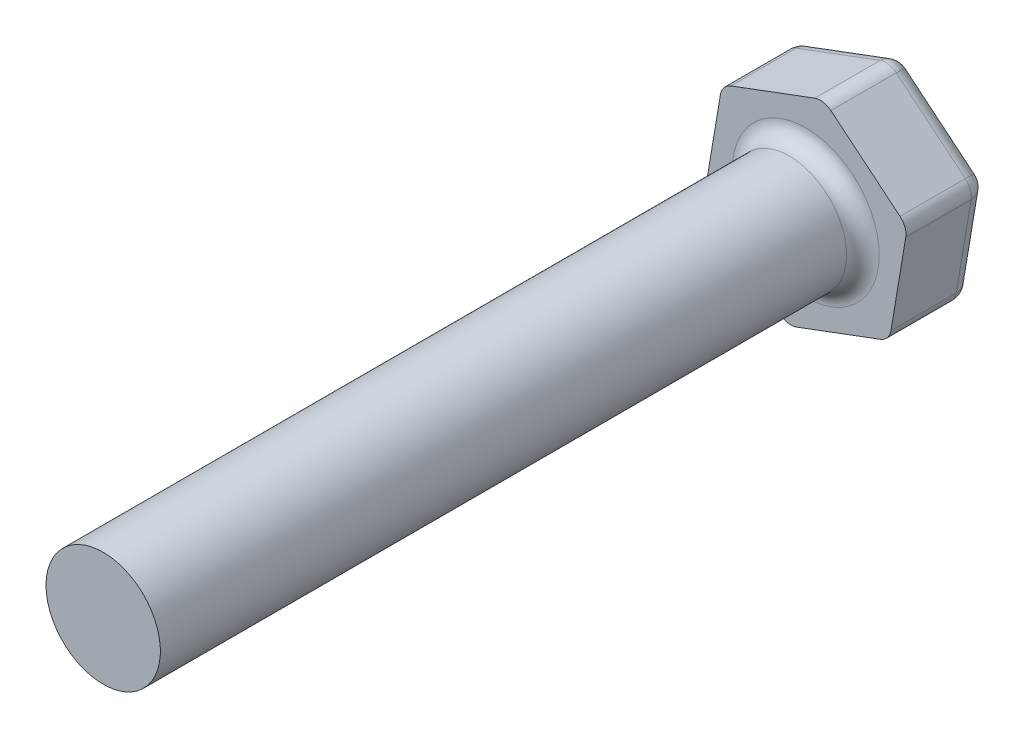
ISO-10303-21;
HEADER;
FILE_DESCRIPTION(('STEP AP214'),'2;1');
FILE_NAME('part.step','',(''),(''),'','','');
FILE_SCHEMA(('AUTOMOTIVE_DESIGN { 1 0 10303 214 1 1 1 1 }'));
ENDSEC;
DATA;
#1=APPLICATION_CONTEXT('core data for automotive mechanical design processes');
#2=APPLICATION_PROTOCOL_DEFINITION('international standard','automotive_design',2000,#1);
#3=PRODUCT_CONTEXT('',#1,'mechanical');
#4=PRODUCT('Part','Part','',(#3));
#5=PRODUCT_RELATED_PRODUCT_CATEGORY('part','',(#4));
#6=PRODUCT_DEFINITION_FORMATION('','',#4);
#7=PRODUCT_DEFINITION_CONTEXT('part definition',#1,'design');
#8=PRODUCT_DEFINITION('design','',#6,#7);
#9=PRODUCT_DEFINITION_SHAPE('','',#8);
#10=(LENGTH_UNIT() NAMED_UNIT(*) SI_UNIT(.MILLI.,.METRE.));
#11=(NAMED_UNIT(*) PLANE_ANGLE_UNIT() SI_UNIT($,.RADIAN.));
#12=(NAMED_UNIT(*) SI_UNIT($,.STERADIAN.) SOLID_ANGLE_UNIT());
#13=UNCERTAINTY_MEASURE_WITH_UNIT(LENGTH_MEASURE(1.E-05),#10,'distance_accuracy_value','');
#14=(GEOMETRIC_REPRESENTATION_CONTEXT(3) GLOBAL_UNCERTAINTY_ASSIGNED_CONTEXT((#13)) GLOBAL_UNIT_ASSIGNED_CONTEXT((#10,
#11,#12)) REPRESENTATION_CONTEXT('',''));
#15=CARTESIAN_POINT('',(0.,0.,0.));
#16=DIRECTION('',(0.,0.,1.));
#17=DIRECTION('',(1.,0.,0.));
#18=AXIS2_PLACEMENT_3D('',#15,#16,#17);
#19=CARTESIAN_POINT('',(-20.4941550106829,4.15454619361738,-4.));
#20=DIRECTION('',(0.,0.,-1.));
#21=DIRECTION('',(-1.,0.,0.));
#22=AXIS2_PLACEMENT_3D('',#19,#20,#21);
#23=PLANE('',#22);
#24=CARTESIAN_POINT('',(-20.4941550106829,4.15454619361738,-4.));
#25=DIRECTION('',(0.,0.,-1.));
#26=DIRECTION('',(-1.,0.,0.));
#27=AXIS2_PLACEMENT_3D('',#24,#25,#26);
#28=CIRCLE('',#27,4.5);
#29=CARTESIAN_POINT('',(-24.9941550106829,4.15454619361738,-4.));
#30=VERTEX_POINT('',#29);
#31=EDGE_CURVE('E163',#30,#30,#28,.T.);
#32=ORIENTED_EDGE('',*,*,#31,.T.);
#33=EDGE_LOOP('',(#32));
#34=FACE_BOUND('',#33,.T.);
#35=ADVANCED_FACE('F16',(#34),#23,.T.);
#36=CARTESIAN_POINT('',(-20.4941550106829,4.15454619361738,-4.));
#37=DIRECTION('',(0.,0.,-1.));
#38=DIRECTION('',(-1.,0.,0.));
#39=AXIS2_PLACEMENT_3D('',#36,#37,#38);
#40=CYLINDRICAL_SURFACE('',#39,4.5);
#41=CARTESIAN_POINT('',(-20.4941550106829,4.15454619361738,-5.));
#42=DIRECTION('',(0.,0.,-1.));
#43=DIRECTION('',(-1.,0.,0.));
#44=AXIS2_PLACEMENT_3D('',#41,#42,#43);
#45=CIRCLE('',#44,4.5);
#46=CARTESIAN_POINT('',(-24.9941550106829,4.15454619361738,-5.));
#47=VERTEX_POINT('',#46);
#48=EDGE_CURVE('E160',#47,#47,#45,.F.);
#49=ORIENTED_EDGE('',*,*,#48,.F.);
#50=EDGE_LOOP('',(#49));
#51=FACE_BOUND('',#50,.T.);
#52=ORIENTED_EDGE('',*,*,#31,.F.);
#53=EDGE_LOOP('',(#52));
#54=FACE_BOUND('',#53,.T.);
#55=ADVANCED_FACE('F489',(#51,#54),#40,.F.);
#56=CARTESIAN_POINT('',(-24.6377443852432,7.51985898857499,-4.));
#57=DIRECTION('',(1.,0.,0.));
#58=DIRECTION('',(0.,0.,-1.));
#59=AXIS2_PLACEMENT_3D('',#56,#57,#58);
#60=SPHERICAL_SURFACE('',#59,1.);
#61=CARTESIAN_POINT('',(-24.6377443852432,7.51985898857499,-4.));
#62=DIRECTION('',(-0.93679219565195,-0.349886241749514,0.));
#63=DIRECTION('',(0.349886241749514,-0.93679219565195,0.));
#64=AXIS2_PLACEMENT_3D('',#61,#62,#63);
#65=CIRCLE('',#64,1.);
#66=CARTESIAN_POINT('',(-24.6377443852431,7.519858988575,-5.));
#67=VERTEX_POINT('',#66);
#68=CARTESIAN_POINT('',(-24.9876306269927,8.45665118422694,-4.));
#69=VERTEX_POINT('',#68);
#70=EDGE_CURVE('E212',#67,#69,#65,.F.);
#71=ORIENTED_EDGE('',*,*,#70,.F.);
#72=CARTESIAN_POINT('',(-24.6377443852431,7.519858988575,-4.));
#73=DIRECTION('',(-0.165385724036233,-0.986228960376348,0.));
#74=DIRECTION('',(0.986228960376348,-0.165385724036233,0.));
#75=AXIS2_PLACEMENT_3D('',#72,#73,#74);
#76=CIRCLE('',#75,0.999999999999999);
#77=CARTESIAN_POINT('',(-25.6239733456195,7.68524471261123,-4.));
#78=VERTEX_POINT('',#77);
#79=EDGE_CURVE('E134',#78,#67,#76,.T.);
#80=ORIENTED_EDGE('',*,*,#79,.F.);
#81=CARTESIAN_POINT('',(-24.6377443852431,7.51985898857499,-4.));
#82=DIRECTION('',(0.,0.,1.));
#83=DIRECTION('',(1.,0.,0.));
#84=AXIS2_PLACEMENT_3D('',#81,#82,#83);
#85=CIRCLE('',#84,1.);
#86=EDGE_CURVE('E218',#69,#78,#85,.T.);
#87=ORIENTED_EDGE('',*,*,#86,.F.);
#88=EDGE_LOOP('',(#71,#80,#87));
#89=FACE_BOUND('',#88,.T.);
#90=ADVANCED_FACE('F484',(#89),#60,.T.);
#91=CARTESIAN_POINT('',(-19.4996007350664,9.43892468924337,-4.));
#92=DIRECTION('',(1.,0.,0.));
#93=DIRECTION('',(0.,0.,-1.));
#94=AXIS2_PLACEMENT_3D('',#91,#92,#93);
#95=SPHERICAL_SURFACE('',#94,1.);
#96=CARTESIAN_POINT('',(-19.4996007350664,9.43892468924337,-4.));
#97=DIRECTION('',(-0.93679219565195,-0.349886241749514,0.));
#98=DIRECTION('',(0.349886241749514,-0.93679219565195,0.));
#99=AXIS2_PLACEMENT_3D('',#96,#97,#98);
#100=CIRCLE('',#99,1.);
#101=CARTESIAN_POINT('',(-19.8494869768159,10.3757168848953,-4.));
#102=VERTEX_POINT('',#101);
#103=CARTESIAN_POINT('',(-19.4996007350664,9.43892468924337,-5.));
#104=VERTEX_POINT('',#103);
#105=EDGE_CURVE('E209',#102,#104,#100,.T.);
#106=ORIENTED_EDGE('',*,*,#105,.F.);
#107=CARTESIAN_POINT('',(-19.4996007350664,9.43892468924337,-4.));
#108=DIRECTION('',(0.,0.,1.));
#109=DIRECTION('',(1.,0.,0.));
#110=AXIS2_PLACEMENT_3D('',#107,#108,#109);
#111=CIRCLE('',#110,1.);
#112=CARTESIAN_POINT('',(-18.8632580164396,10.2103311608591,-4.));
#113=VERTEX_POINT('',#112);
#114=EDGE_CURVE('E207',#113,#102,#111,.T.);
#115=ORIENTED_EDGE('',*,*,#114,.F.);
#116=CARTESIAN_POINT('',(-19.4996007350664,9.43892468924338,-4.));
#117=DIRECTION('',(-0.771406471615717,0.636342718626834,0.));
#118=DIRECTION('',(-0.636342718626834,-0.771406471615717,0.));
#119=AXIS2_PLACEMENT_3D('',#116,#117,#118);
#120=CIRCLE('',#119,1.);
#121=EDGE_CURVE('E201',#104,#113,#120,.F.);
#122=ORIENTED_EDGE('',*,*,#121,.F.);
#123=EDGE_LOOP('',(#106,#115,#122));
#124=FACE_BOUND('',#123,.T.);
#125=ADVANCED_FACE('F380',(#124),#95,.T.);
#126=CARTESIAN_POINT('',(-15.2685692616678,5.94869461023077,-4.));
#127=DIRECTION('',(1.,0.,0.));
#128=DIRECTION('',(0.,0.,-1.));
#129=AXIS2_PLACEMENT_3D('',#126,#127,#128);
#130=SPHERICAL_SURFACE('',#129,1.);
#131=CARTESIAN_POINT('',(-15.2685692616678,5.94869461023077,-4.));
#132=DIRECTION('',(0.165385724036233,0.986228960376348,0.));
#133=DIRECTION('',(-0.986228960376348,0.165385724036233,0.));
#134=AXIS2_PLACEMENT_3D('',#131,#132,#133);
#135=CIRCLE('',#134,0.999999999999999);
#136=CARTESIAN_POINT('',(-15.2685692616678,5.94869461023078,-5.));
#137=VERTEX_POINT('',#136);
#138=CARTESIAN_POINT('',(-14.2823403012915,5.78330888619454,-4.));
#139=VERTEX_POINT('',#138);
#140=EDGE_CURVE('E191',#137,#139,#135,.F.);
#141=ORIENTED_EDGE('',*,*,#140,.F.);
#142=CARTESIAN_POINT('',(-15.2685692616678,5.94869461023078,-4.));
#143=DIRECTION('',(-0.771406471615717,0.636342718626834,0.));
#144=DIRECTION('',(-0.636342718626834,-0.771406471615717,0.));
#145=AXIS2_PLACEMENT_3D('',#142,#143,#144);
#146=CIRCLE('',#145,1.);
#147=CARTESIAN_POINT('',(-14.632226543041,6.7201010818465,-4.));
#148=VERTEX_POINT('',#147);
#149=EDGE_CURVE('E198',#148,#137,#146,.T.);
#150=ORIENTED_EDGE('',*,*,#149,.F.);
#151=CARTESIAN_POINT('',(-15.2685692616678,5.94869461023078,-4.));
#152=DIRECTION('',(0.,0.,1.));
#153=DIRECTION('',(1.,0.,0.));
#154=AXIS2_PLACEMENT_3D('',#151,#152,#153);
#155=CIRCLE('',#154,0.999999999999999);
#156=CARTESIAN_POINT('',(-14.2685692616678,5.94869461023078,-4.));
#157=VERTEX_POINT('',#156);
#158=EDGE_CURVE('E208',#157,#148,#155,.T.);
#159=ORIENTED_EDGE('',*,*,#158,.F.);
#160=CARTESIAN_POINT('',(-15.2685692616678,5.94869461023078,-4.));
#161=DIRECTION('',(0.,0.,1.));
#162=DIRECTION('',(1.,0.,0.));
#163=AXIS2_PLACEMENT_3D('',#160,#161,#162);
#164=CIRCLE('',#163,0.999999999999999);
#165=EDGE_CURVE('E197',#139,#157,#164,.T.);
#166=ORIENTED_EDGE('',*,*,#165,.F.);
#167=EDGE_LOOP('',(#141,#150,#159,#166));
#168=FACE_BOUND('',#167,.T.);
#169=ADVANCED_FACE('F375',(#168),#130,.T.);
#170=CARTESIAN_POINT('',(-16.175681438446,0.539398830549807,-4.));
#171=DIRECTION('',(1.,0.,0.));
#172=DIRECTION('',(0.,0.,-1.));
#173=AXIS2_PLACEMENT_3D('',#170,#171,#172);
#174=SPHERICAL_SURFACE('',#173,1.);
#175=CARTESIAN_POINT('',(-16.175681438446,0.539398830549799,-4.));
#176=DIRECTION('',(0.165385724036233,0.986228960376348,0.));
#177=DIRECTION('',(-0.986228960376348,0.165385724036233,0.));
#178=AXIS2_PLACEMENT_3D('',#175,#176,#177);
#179=CIRCLE('',#178,0.999999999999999);
#180=CARTESIAN_POINT('',(-15.1894524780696,0.374013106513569,-4.));
#181=VERTEX_POINT('',#180);
#182=CARTESIAN_POINT('',(-16.175681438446,0.539398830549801,-5.));
#183=VERTEX_POINT('',#182);
#184=EDGE_CURVE('E188',#181,#183,#179,.T.);
#185=ORIENTED_EDGE('',*,*,#184,.F.);
#186=CARTESIAN_POINT('',(-16.175681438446,0.539398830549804,-4.));
#187=DIRECTION('',(0.,0.,1.));
#188=DIRECTION('',(1.,0.,0.));
#189=AXIS2_PLACEMENT_3D('',#186,#187,#188);
#190=CIRCLE('',#189,1.);
#191=CARTESIAN_POINT('',(-15.8257951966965,-0.397393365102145,-4.));
#192=VERTEX_POINT('',#191);
#193=EDGE_CURVE('E185',#192,#181,#190,.T.);
#194=ORIENTED_EDGE('',*,*,#193,.F.);
#195=CARTESIAN_POINT('',(-16.175681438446,0.539398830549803,-4.));
#196=DIRECTION('',(0.93679219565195,0.349886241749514,0.));
#197=DIRECTION('',(-0.349886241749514,0.93679219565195,0.));
#198=AXIS2_PLACEMENT_3D('',#195,#196,#197);
#199=CIRCLE('',#198,1.);
#200=EDGE_CURVE('E179',#183,#192,#199,.F.);
#201=ORIENTED_EDGE('',*,*,#200,.F.);
#202=EDGE_LOOP('',(#185,#194,#201));
#203=FACE_BOUND('',#202,.T.);
#204=ADVANCED_FACE('F372',(#203),#174,.T.);
#205=CARTESIAN_POINT('',(0.,0.,-5.));
#206=DIRECTION('',(0.,0.,-1.));
#207=DIRECTION('',(-1.,0.,0.));
#208=AXIS2_PLACEMENT_3D('',#205,#206,#207);
#209=PLANE('',#208);
#210=ORIENTED_EDGE('',*,*,#48,.T.);
#211=EDGE_LOOP('',(#210));
#212=FACE_BOUND('',#211,.T.);
#213=DIRECTION('',(-0.93679219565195,-0.349886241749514,0.));
#214=VECTOR('',#213,1.);
#215=CARTESIAN_POINT('',(-5.480951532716,14.6748057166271,-5.));
#216=LINE('',#215,#214);
#217=EDGE_CURVE('E215',#104,#67,#216,.T.);
#218=ORIENTED_EDGE('',*,*,#217,.F.);
#219=DIRECTION('',(-0.771406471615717,0.636342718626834,0.));
#220=VECTOR('',#219,1.);
#221=CARTESIAN_POINT('',(-3.26264452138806,-3.95514087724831,-5.));
#222=LINE('',#221,#220);
#223=EDGE_CURVE('E204',#137,#104,#222,.T.);
#224=ORIENTED_EDGE('',*,*,#223,.F.);
#225=DIRECTION('',(0.165385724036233,0.986228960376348,0.));
#226=VECTOR('',#225,1.);
#227=CARTESIAN_POINT('',(-15.8212174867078,2.65314000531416,-5.));
#228=LINE('',#227,#226);
#229=EDGE_CURVE('E194',#183,#137,#228,.T.);
#230=ORIENTED_EDGE('',*,*,#229,.F.);
#231=DIRECTION('',(0.93679219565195,0.349886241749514,0.));
#232=VECTOR('',#231,1.);
#233=CARTESIAN_POINT('',(-2.1570322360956,5.77527985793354,-5.));
#234=LINE('',#233,#232);
#235=CARTESIAN_POINT('',(-21.3138250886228,-1.37966687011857,-5.));
#236=VERTEX_POINT('',#235);
#237=EDGE_CURVE('E155',#236,#183,#234,.T.);
#238=ORIENTED_EDGE('',*,*,#237,.F.);
#239=DIRECTION('',(0.771406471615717,-0.636342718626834,0.));
#240=VECTOR('',#239,1.);
#241=CARTESIAN_POINT('',(-9.30790034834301,-11.2835023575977,-5.));
#242=LINE('',#241,#240);
#243=CARTESIAN_POINT('',(-25.5448565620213,2.11056320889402,-5.));
#244=VERTEX_POINT('',#243);
#245=EDGE_CURVE('E143',#244,#236,#242,.T.);
#246=ORIENTED_EDGE('',*,*,#245,.F.);
#247=DIRECTION('',(-0.165385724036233,-0.986228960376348,0.));
#248=VECTOR('',#247,1.);
#249=CARTESIAN_POINT('',(-25.1903926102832,4.22430438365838,-5.));
#250=LINE('',#249,#248);
#251=EDGE_CURVE('E135',#67,#244,#250,.T.);
#252=ORIENTED_EDGE('',*,*,#251,.F.);
#253=EDGE_LOOP('',(#218,#224,#230,#238,#246,#252));
#254=FACE_BOUND('',#253,.T.);
#255=ADVANCED_FACE('F152',(#212,#254),#209,.T.);
#256=CARTESIAN_POINT('',(-21.3138250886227,-1.37966687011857,-4.));
#257=DIRECTION('',(1.,0.,0.));
#258=DIRECTION('',(0.,0.,-1.));
#259=AXIS2_PLACEMENT_3D('',#256,#257,#258);
#260=SPHERICAL_SURFACE('',#259,1.);
#261=CARTESIAN_POINT('',(-21.3138250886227,-1.37966687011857,-4.));
#262=DIRECTION('',(0.771406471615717,-0.636342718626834,0.));
#263=DIRECTION('',(0.636342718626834,0.771406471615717,0.));
#264=AXIS2_PLACEMENT_3D('',#261,#262,#263);
#265=CIRCLE('',#264,1.);
#266=CARTESIAN_POINT('',(-21.9501678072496,-2.15107334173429,-4.));
#267=VERTEX_POINT('',#266);
#268=EDGE_CURVE('E149',#236,#267,#265,.F.);
#269=ORIENTED_EDGE('',*,*,#268,.F.);
#270=CARTESIAN_POINT('',(-21.3138250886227,-1.37966687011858,-4.));
#271=DIRECTION('',(0.93679219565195,0.349886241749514,0.));
#272=DIRECTION('',(-0.349886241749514,0.93679219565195,0.));
#273=AXIS2_PLACEMENT_3D('',#270,#271,#272);
#274=CIRCLE('',#273,1.);
#275=CARTESIAN_POINT('',(-20.9639388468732,-2.31645906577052,-4.));
#276=VERTEX_POINT('',#275);
#277=EDGE_CURVE('E182',#276,#236,#274,.T.);
#278=ORIENTED_EDGE('',*,*,#277,.F.);
#279=CARTESIAN_POINT('',(-21.3138250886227,-1.37966687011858,-4.));
#280=DIRECTION('',(0.,0.,1.));
#281=DIRECTION('',(1.,0.,0.));
#282=AXIS2_PLACEMENT_3D('',#279,#280,#281);
#283=CIRCLE('',#282,1.);
#284=EDGE_CURVE('E156',#267,#276,#283,.T.);
#285=ORIENTED_EDGE('',*,*,#284,.F.);
#286=EDGE_LOOP('',(#269,#278,#285));
#287=FACE_BOUND('',#286,.T.);
#288=ADVANCED_FACE('F359',(#287),#260,.T.);
#289=CARTESIAN_POINT('',(-25.5448565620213,2.11056320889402,-4.));
#290=DIRECTION('',(1.,0.,0.));
#291=DIRECTION('',(0.,0.,-1.));
#292=AXIS2_PLACEMENT_3D('',#289,#290,#291);
#293=SPHERICAL_SURFACE('',#292,1.);
#294=CARTESIAN_POINT('',(-25.5448565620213,2.11056320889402,-4.));
#295=DIRECTION('',(-0.165385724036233,-0.986228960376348,0.));
#296=DIRECTION('',(0.986228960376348,-0.165385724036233,0.));
#297=AXIS2_PLACEMENT_3D('',#294,#295,#296);
#298=CIRCLE('',#297,0.999999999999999);
#299=CARTESIAN_POINT('',(-26.5310855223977,2.27594893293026,-4.));
#300=VERTEX_POINT('',#299);
#301=EDGE_CURVE('E124',#244,#300,#298,.F.);
#302=ORIENTED_EDGE('',*,*,#301,.F.);
#303=CARTESIAN_POINT('',(-25.5448565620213,2.11056320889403,-4.));
#304=DIRECTION('',(0.771406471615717,-0.636342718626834,0.));
#305=DIRECTION('',(0.636342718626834,0.771406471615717,0.));
#306=AXIS2_PLACEMENT_3D('',#303,#304,#305);
#307=CIRCLE('',#306,1.);
#308=CARTESIAN_POINT('',(-26.1811992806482,1.33915673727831,-4.));
#309=VERTEX_POINT('',#308);
#310=EDGE_CURVE('E127',#309,#244,#307,.T.);
#311=ORIENTED_EDGE('',*,*,#310,.F.);
#312=CARTESIAN_POINT('',(-25.5448565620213,2.11056320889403,-4.));
#313=DIRECTION('',(0.,0.,1.));
#314=DIRECTION('',(1.,0.,0.));
#315=AXIS2_PLACEMENT_3D('',#312,#313,#314);
#316=CIRCLE('',#315,1.);
#317=CARTESIAN_POINT('',(-26.5448565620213,2.11056320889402,-4.));
#318=VERTEX_POINT('',#317);
#319=EDGE_CURVE('E36',#318,#309,#316,.T.);
#320=ORIENTED_EDGE('',*,*,#319,.F.);
#321=CARTESIAN_POINT('',(-25.5448565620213,2.11056320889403,-4.));
#322=DIRECTION('',(0.,0.,1.));
#323=DIRECTION('',(1.,0.,0.));
#324=AXIS2_PLACEMENT_3D('',#321,#322,#323);
#325=CIRCLE('',#324,1.);
#326=EDGE_CURVE('E128',#300,#318,#325,.T.);
#327=ORIENTED_EDGE('',*,*,#326,.F.);
#328=EDGE_LOOP('',(#302,#311,#320,#327));
#329=FACE_BOUND('',#328,.T.);
#330=ADVANCED_FACE('F126',(#329),#293,.T.);
#331=CARTESIAN_POINT('',(-25.1903926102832,4.22430438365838,-4.));
#332=DIRECTION('',(-0.165385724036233,-0.986228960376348,0.));
#333=DIRECTION('',(0.986228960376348,-0.165385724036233,0.));
#334=AXIS2_PLACEMENT_3D('',#331,#332,#333);
#335=CYLINDRICAL_SURFACE('',#334,0.999999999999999);
#336=DIRECTION('',(0.165385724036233,0.986228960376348,0.));
#337=VECTOR('',#336,1.);
#338=CARTESIAN_POINT('',(-26.6265710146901,1.70654937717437,-4.));
#339=LINE('',#338,#337);
#340=EDGE_CURVE('E364',#300,#78,#339,.T.);
#341=ORIENTED_EDGE('',*,*,#340,.T.);
#342=ORIENTED_EDGE('',*,*,#79,.T.);
#343=ORIENTED_EDGE('',*,*,#251,.T.);
#344=ORIENTED_EDGE('',*,*,#301,.T.);
#345=EDGE_LOOP('',(#341,#342,#343,#344));
#346=FACE_BOUND('',#345,.T.);
#347=ADVANCED_FACE('F159',(#346),#335,.T.);
#348=CARTESIAN_POINT('',(-24.6377443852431,7.51985898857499,-5.));
#349=DIRECTION('',(0.,0.,1.));
#350=DIRECTION('',(1.,0.,0.));
#351=AXIS2_PLACEMENT_3D('',#348,#349,#350);
#352=CYLINDRICAL_SURFACE('',#351,1.);
#353=ORIENTED_EDGE('',*,*,#86,.T.);
#354=DIRECTION('',(0.,0.,1.));
#355=VECTOR('',#354,1.);
#356=CARTESIAN_POINT('',(-25.6239733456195,7.68524471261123,-5.));
#357=LINE('',#356,#355);
#358=CARTESIAN_POINT('',(-25.6239733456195,7.68524471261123,0.));
#359=VERTEX_POINT('',#358);
#360=EDGE_CURVE('E148',#78,#359,#357,.T.);
#361=ORIENTED_EDGE('',*,*,#360,.T.);
#362=CARTESIAN_POINT('',(-24.6377443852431,7.51985898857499,0.));
#363=DIRECTION('',(0.,0.,1.));
#364=DIRECTION('',(1.,0.,0.));
#365=AXIS2_PLACEMENT_3D('',#362,#363,#364);
#366=CIRCLE('',#365,1.);
#367=CARTESIAN_POINT('',(-24.9876306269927,8.45665118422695,0.));
#368=VERTEX_POINT('',#367);
#369=EDGE_CURVE('E216',#359,#368,#366,.F.);
#370=ORIENTED_EDGE('',*,*,#369,.T.);
#371=DIRECTION('',(0.,0.,1.));
#372=VECTOR('',#371,1.);
#373=CARTESIAN_POINT('',(-24.9876306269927,8.45665118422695,-5.));
#374=LINE('',#373,#372);
#375=EDGE_CURVE('E399',#368,#69,#374,.F.);
#376=ORIENTED_EDGE('',*,*,#375,.T.);
#377=EDGE_LOOP('',(#353,#361,#370,#376));
#378=FACE_BOUND('',#377,.T.);
#379=ADVANCED_FACE('F349',(#378),#352,.T.);
#380=CARTESIAN_POINT('',(-5.480951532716,14.6748057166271,-4.));
#381=DIRECTION('',(-0.93679219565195,-0.349886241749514,0.));
#382=DIRECTION('',(0.349886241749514,-0.93679219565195,0.));
#383=AXIS2_PLACEMENT_3D('',#380,#381,#382);
#384=CYLINDRICAL_SURFACE('',#383,1.);
#385=DIRECTION('',(0.93679219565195,0.349886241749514,0.));
#386=VECTOR('',#385,1.);
#387=CARTESIAN_POINT('',(-25.5284878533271,8.25464426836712,-4.));
#388=LINE('',#387,#386);
#389=EDGE_CURVE('E396',#69,#102,#388,.T.);
#390=ORIENTED_EDGE('',*,*,#389,.T.);
#391=ORIENTED_EDGE('',*,*,#105,.T.);
#392=ORIENTED_EDGE('',*,*,#217,.T.);
#393=ORIENTED_EDGE('',*,*,#70,.T.);
#394=EDGE_LOOP('',(#390,#391,#392,#393));
#395=FACE_BOUND('',#394,.T.);
#396=ADVANCED_FACE('F345',(#395),#384,.T.);
#397=CARTESIAN_POINT('',(-19.4996007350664,9.43892468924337,-5.));
#398=DIRECTION('',(0.,0.,1.));
#399=DIRECTION('',(1.,0.,0.));
#400=AXIS2_PLACEMENT_3D('',#397,#398,#399);
#401=CYLINDRICAL_SURFACE('',#400,1.);
#402=ORIENTED_EDGE('',*,*,#114,.T.);
#403=DIRECTION('',(0.,0.,1.));
#404=VECTOR('',#403,1.);
#405=CARTESIAN_POINT('',(-19.8494869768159,10.3757168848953,-5.));
#406=LINE('',#405,#404);
#407=CARTESIAN_POINT('',(-19.8494869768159,10.3757168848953,0.));
#408=VERTEX_POINT('',#407);
#409=EDGE_CURVE('E405',#102,#408,#406,.T.);
#410=ORIENTED_EDGE('',*,*,#409,.T.);
#411=CARTESIAN_POINT('',(-19.4996007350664,9.43892468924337,0.));
#412=DIRECTION('',(0.,0.,1.));
#413=DIRECTION('',(1.,0.,0.));
#414=AXIS2_PLACEMENT_3D('',#411,#412,#413);
#415=CIRCLE('',#414,1.);
#416=CARTESIAN_POINT('',(-18.8632580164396,10.2103311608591,0.));
#417=VERTEX_POINT('',#416);
#418=EDGE_CURVE('E205',#408,#417,#415,.F.);
#419=ORIENTED_EDGE('',*,*,#418,.T.);
#420=DIRECTION('',(0.,0.,1.));
#421=VECTOR('',#420,1.);
#422=CARTESIAN_POINT('',(-18.8632580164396,10.2103311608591,-5.));
#423=LINE('',#422,#421);
#424=EDGE_CURVE('E403',#417,#113,#423,.F.);
#425=ORIENTED_EDGE('',*,*,#424,.T.);
#426=EDGE_LOOP('',(#402,#410,#419,#425));
#427=FACE_BOUND('',#426,.T.);
#428=ADVANCED_FACE('F341',(#427),#401,.T.);
#429=CARTESIAN_POINT('',(-3.26264452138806,-3.95514087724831,-4.));
#430=DIRECTION('',(-0.771406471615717,0.636342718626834,0.));
#431=DIRECTION('',(-0.636342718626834,-0.771406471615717,0.));
#432=AXIS2_PLACEMENT_3D('',#429,#430,#431);
#433=CYLINDRICAL_SURFACE('',#432,1.);
#434=DIRECTION('',(0.771406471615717,-0.636342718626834,0.));
#435=VECTOR('',#434,1.);
#436=CARTESIAN_POINT('',(-19.3086297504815,10.5777238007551,-4.));
#437=LINE('',#436,#435);
#438=EDGE_CURVE('E437',#113,#148,#437,.T.);
#439=ORIENTED_EDGE('',*,*,#438,.T.);
#440=ORIENTED_EDGE('',*,*,#149,.T.);
#441=ORIENTED_EDGE('',*,*,#223,.T.);
#442=ORIENTED_EDGE('',*,*,#121,.T.);
#443=EDGE_LOOP('',(#439,#440,#441,#442));
#444=FACE_BOUND('',#443,.T.);
#445=ADVANCED_FACE('F337',(#444),#433,.T.);
#446=CARTESIAN_POINT('',(-15.2685692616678,5.94869461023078,-5.));
#447=DIRECTION('',(0.,0.,1.));
#448=DIRECTION('',(1.,0.,0.));
#449=AXIS2_PLACEMENT_3D('',#446,#447,#448);
#450=CYLINDRICAL_SURFACE('',#449,0.999999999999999);
#451=CARTESIAN_POINT('',(-15.2685692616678,5.94869461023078,0.));
#452=DIRECTION('',(0.,0.,1.));
#453=DIRECTION('',(1.,0.,0.));
#454=AXIS2_PLACEMENT_3D('',#451,#452,#453);
#455=CIRCLE('',#454,0.999999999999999);
#456=CARTESIAN_POINT('',(-14.632226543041,6.72010108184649,0.));
#457=VERTEX_POINT('',#456);
#458=CARTESIAN_POINT('',(-14.2823403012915,5.78330888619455,0.));
#459=VERTEX_POINT('',#458);
#460=EDGE_CURVE('E195',#457,#459,#455,.F.);
#461=ORIENTED_EDGE('',*,*,#460,.T.);
#462=DIRECTION('',(0.,0.,1.));
#463=VECTOR('',#462,1.);
#464=CARTESIAN_POINT('',(-14.2823403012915,5.78330888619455,-5.));
#465=LINE('',#464,#463);
#466=EDGE_CURVE('E434',#459,#139,#465,.F.);
#467=ORIENTED_EDGE('',*,*,#466,.T.);
#468=ORIENTED_EDGE('',*,*,#165,.T.);
#469=ORIENTED_EDGE('',*,*,#158,.T.);
#470=DIRECTION('',(0.,0.,1.));
#471=VECTOR('',#470,1.);
#472=CARTESIAN_POINT('',(-14.632226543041,6.72010108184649,-5.));
#473=LINE('',#472,#471);
#474=EDGE_CURVE('E398',#148,#457,#473,.T.);
#475=ORIENTED_EDGE('',*,*,#474,.T.);
#476=EDGE_LOOP('',(#461,#467,#468,#469,#475));
#477=FACE_BOUND('',#476,.T.);
#478=ADVANCED_FACE('F333',(#477),#450,.T.);
#479=CARTESIAN_POINT('',(-15.8212174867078,2.65314000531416,-4.));
#480=DIRECTION('',(0.165385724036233,0.986228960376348,0.));
#481=DIRECTION('',(-0.986228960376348,0.165385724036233,0.));
#482=AXIS2_PLACEMENT_3D('',#479,#480,#481);
#483=CYLINDRICAL_SURFACE('',#482,0.999999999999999);
#484=DIRECTION('',(-0.165385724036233,-0.986228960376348,0.));
#485=VECTOR('',#484,1.);
#486=CARTESIAN_POINT('',(-14.186854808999,6.35270844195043,-4.));
#487=LINE('',#486,#485);
#488=EDGE_CURVE('E431',#139,#181,#487,.T.);
#489=ORIENTED_EDGE('',*,*,#488,.T.);
#490=ORIENTED_EDGE('',*,*,#184,.T.);
#491=ORIENTED_EDGE('',*,*,#229,.T.);
#492=ORIENTED_EDGE('',*,*,#140,.T.);
#493=EDGE_LOOP('',(#489,#490,#491,#492));
#494=FACE_BOUND('',#493,.T.);
#495=ADVANCED_FACE('F329',(#494),#483,.T.);
#496=CARTESIAN_POINT('',(-16.175681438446,0.539398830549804,-5.));
#497=DIRECTION('',(0.,0.,1.));
#498=DIRECTION('',(1.,0.,0.));
#499=AXIS2_PLACEMENT_3D('',#496,#497,#498);
#500=CYLINDRICAL_SURFACE('',#499,1.);
#501=ORIENTED_EDGE('',*,*,#193,.T.);
#502=DIRECTION('',(0.,0.,1.));
#503=VECTOR('',#502,1.);
#504=CARTESIAN_POINT('',(-15.1894524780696,0.374013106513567,-5.));
#505=LINE('',#504,#503);
#506=CARTESIAN_POINT('',(-15.1894524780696,0.374013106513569,0.));
#507=VERTEX_POINT('',#506);
#508=EDGE_CURVE('E439',#181,#507,#505,.T.);
#509=ORIENTED_EDGE('',*,*,#508,.T.);
#510=CARTESIAN_POINT('',(-16.175681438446,0.539398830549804,0.));
#511=DIRECTION('',(0.,0.,1.));
#512=DIRECTION('',(1.,0.,0.));
#513=AXIS2_PLACEMENT_3D('',#510,#511,#512);
#514=CIRCLE('',#513,1.);
#515=CARTESIAN_POINT('',(-15.8257951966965,-0.397393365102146,0.));
#516=VERTEX_POINT('',#515);
#517=EDGE_CURVE('E186',#507,#516,#514,.F.);
#518=ORIENTED_EDGE('',*,*,#517,.T.);
#519=DIRECTION('',(0.,0.,1.));
#520=VECTOR('',#519,1.);
#521=CARTESIAN_POINT('',(-15.8257951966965,-0.397393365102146,-5.));
#522=LINE('',#521,#520);
#523=EDGE_CURVE('E424',#516,#192,#522,.F.);
#524=ORIENTED_EDGE('',*,*,#523,.T.);
#525=EDGE_LOOP('',(#501,#509,#518,#524));
#526=FACE_BOUND('',#525,.T.);
#527=ADVANCED_FACE('F325',(#526),#500,.T.);
#528=CARTESIAN_POINT('',(-2.1570322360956,5.77527985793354,-4.));
#529=DIRECTION('',(0.93679219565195,0.349886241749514,0.));
#530=DIRECTION('',(-0.349886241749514,0.93679219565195,0.));
#531=AXIS2_PLACEMENT_3D('',#528,#529,#530);
#532=CYLINDRICAL_SURFACE('',#531,1.);
#533=ORIENTED_EDGE('',*,*,#237,.T.);
#534=ORIENTED_EDGE('',*,*,#200,.T.);
#535=DIRECTION('',(-0.93679219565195,-0.349886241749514,0.));
#536=VECTOR('',#535,1.);
#537=CARTESIAN_POINT('',(-15.2849379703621,-0.195386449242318,-4.));
#538=LINE('',#537,#536);
#539=EDGE_CURVE('E420',#192,#276,#538,.T.);
#540=ORIENTED_EDGE('',*,*,#539,.T.);
#541=ORIENTED_EDGE('',*,*,#277,.T.);
#542=EDGE_LOOP('',(#533,#534,#540,#541));
#543=FACE_BOUND('',#542,.T.);
#544=ADVANCED_FACE('F321',(#543),#532,.T.);
#545=CARTESIAN_POINT('',(-25.5448565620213,2.11056320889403,-5.));
#546=DIRECTION('',(0.,0.,1.));
#547=DIRECTION('',(1.,0.,0.));
#548=AXIS2_PLACEMENT_3D('',#545,#546,#547);
#549=CYLINDRICAL_SURFACE('',#548,1.);
#550=ORIENTED_EDGE('',*,*,#319,.T.);
#551=DIRECTION('',(0.,0.,1.));
#552=VECTOR('',#551,1.);
#553=CARTESIAN_POINT('',(-26.1811992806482,1.33915673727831,-5.));
#554=LINE('',#553,#552);
#555=CARTESIAN_POINT('',(-26.1811992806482,1.33915673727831,0.));
#556=VERTEX_POINT('',#555);
#557=EDGE_CURVE('E464',#309,#556,#554,.T.);
#558=ORIENTED_EDGE('',*,*,#557,.T.);
#559=CARTESIAN_POINT('',(-25.5448565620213,2.11056320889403,0.));
#560=DIRECTION('',(0.,0.,1.));
#561=DIRECTION('',(1.,0.,0.));
#562=AXIS2_PLACEMENT_3D('',#559,#560,#561);
#563=CIRCLE('',#562,1.);
#564=CARTESIAN_POINT('',(-26.5310855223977,2.27594893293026,0.));
#565=VERTEX_POINT('',#564);
#566=EDGE_CURVE('E177',#556,#565,#563,.F.);
#567=ORIENTED_EDGE('',*,*,#566,.T.);
#568=DIRECTION('',(0.,0.,1.));
#569=VECTOR('',#568,1.);
#570=CARTESIAN_POINT('',(-26.5310855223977,2.27594893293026,-5.));
#571=LINE('',#570,#569);
#572=EDGE_CURVE('E412',#565,#300,#571,.F.);
#573=ORIENTED_EDGE('',*,*,#572,.T.);
#574=ORIENTED_EDGE('',*,*,#326,.T.);
#575=EDGE_LOOP('',(#550,#558,#567,#573,#574));
#576=FACE_BOUND('',#575,.T.);
#577=ADVANCED_FACE('F317',(#576),#549,.T.);
#578=CARTESIAN_POINT('',(-21.3138250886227,-1.37966687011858,-5.));
#579=DIRECTION('',(0.,0.,1.));
#580=DIRECTION('',(1.,0.,0.));
#581=AXIS2_PLACEMENT_3D('',#578,#579,#580);
#582=CYLINDRICAL_SURFACE('',#581,1.);
#583=ORIENTED_EDGE('',*,*,#284,.T.);
#584=DIRECTION('',(0.,0.,1.));
#585=VECTOR('',#584,1.);
#586=CARTESIAN_POINT('',(-20.9639388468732,-2.31645906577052,-5.));
#587=LINE('',#586,#585);
#588=CARTESIAN_POINT('',(-20.9639388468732,-2.31645906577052,0.));
#589=VERTEX_POINT('',#588);
#590=EDGE_CURVE('E423',#276,#589,#587,.T.);
#591=ORIENTED_EDGE('',*,*,#590,.T.);
#592=CARTESIAN_POINT('',(-21.3138250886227,-1.37966687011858,0.));
#593=DIRECTION('',(0.,0.,1.));
#594=DIRECTION('',(1.,0.,0.));
#595=AXIS2_PLACEMENT_3D('',#592,#593,#594);
#596=CIRCLE('',#595,1.);
#597=CARTESIAN_POINT('',(-21.9501678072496,-2.15107334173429,0.));
#598=VERTEX_POINT('',#597);
#599=EDGE_CURVE('E173',#589,#598,#596,.F.);
#600=ORIENTED_EDGE('',*,*,#599,.T.);
#601=DIRECTION('',(0.,0.,1.));
#602=VECTOR('',#601,1.);
#603=CARTESIAN_POINT('',(-21.9501678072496,-2.15107334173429,-5.));
#604=LINE('',#603,#602);
#605=EDGE_CURVE('E418',#598,#267,#604,.F.);
#606=ORIENTED_EDGE('',*,*,#605,.T.);
#607=EDGE_LOOP('',(#583,#591,#600,#606));
#608=FACE_BOUND('',#607,.T.);
#609=ADVANCED_FACE('F314',(#608),#582,.T.);
#610=CARTESIAN_POINT('',(-9.30790034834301,-11.2835023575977,-4.));
#611=DIRECTION('',(0.771406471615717,-0.636342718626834,0.));
#612=DIRECTION('',(0.636342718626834,0.771406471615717,0.));
#613=AXIS2_PLACEMENT_3D('',#610,#611,#612);
#614=CYLINDRICAL_SURFACE('',#613,1.);
#615=DIRECTION('',(-0.771406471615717,0.636342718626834,0.));
#616=VECTOR('',#615,1.);
#617=CARTESIAN_POINT('',(-21.5047960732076,-2.51846598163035,-4.));
#618=LINE('',#617,#616);
#619=EDGE_CURVE('E146',#267,#309,#618,.T.);
#620=ORIENTED_EDGE('',*,*,#619,.T.);
#621=ORIENTED_EDGE('',*,*,#310,.T.);
#622=ORIENTED_EDGE('',*,*,#245,.T.);
#623=ORIENTED_EDGE('',*,*,#268,.T.);
#624=EDGE_LOOP('',(#620,#621,#622,#623));
#625=FACE_BOUND('',#624,.T.);
#626=ADVANCED_FACE('F141',(#625),#614,.T.);
#627=CARTESIAN_POINT('',(-26.6265710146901,1.70654937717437,-5.));
#628=DIRECTION('',(0.986228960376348,-0.165385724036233,0.));
#629=DIRECTION('',(0.165385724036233,0.986228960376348,0.));
#630=AXIS2_PLACEMENT_3D('',#627,#628,#629);
#631=PLANE('',#630);
#632=ORIENTED_EDGE('',*,*,#572,.F.);
#633=DIRECTION('',(0.165385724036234,0.986228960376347,0.));
#634=VECTOR('',#633,1.);
#635=CARTESIAN_POINT('',(-26.5310855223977,2.27594893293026,0.));
#636=LINE('',#635,#634);
#637=EDGE_CURVE('E255',#565,#359,#636,.T.);
#638=ORIENTED_EDGE('',*,*,#637,.T.);
#639=ORIENTED_EDGE('',*,*,#360,.F.);
#640=ORIENTED_EDGE('',*,*,#340,.F.);
#641=EDGE_LOOP('',(#632,#638,#639,#640));
#642=FACE_BOUND('',#641,.T.);
#643=ADVANCED_FACE('F307',(#642),#631,.F.);
#644=CARTESIAN_POINT('',(-25.5284878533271,8.25464426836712,-5.));
#645=DIRECTION('',(0.349886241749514,-0.93679219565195,0.));
#646=DIRECTION('',(0.93679219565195,0.349886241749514,0.));
#647=AXIS2_PLACEMENT_3D('',#644,#645,#646);
#648=PLANE('',#647);
#649=ORIENTED_EDGE('',*,*,#375,.F.);
#650=DIRECTION('',(0.93679219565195,0.349886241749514,0.));
#651=VECTOR('',#650,1.);
#652=CARTESIAN_POINT('',(-24.9876306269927,8.45665118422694,0.));
#653=LINE('',#652,#651);
#654=EDGE_CURVE('E252',#368,#408,#653,.T.);
#655=ORIENTED_EDGE('',*,*,#654,.T.);
#656=ORIENTED_EDGE('',*,*,#409,.F.);
#657=ORIENTED_EDGE('',*,*,#389,.F.);
#658=EDGE_LOOP('',(#649,#655,#656,#657));
#659=FACE_BOUND('',#658,.T.);
#660=ADVANCED_FACE('F303',(#659),#648,.F.);
#661=CARTESIAN_POINT('',(-19.3086297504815,10.5777238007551,-5.));
#662=DIRECTION('',(-0.636342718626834,-0.771406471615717,0.));
#663=DIRECTION('',(0.771406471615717,-0.636342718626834,0.));
#664=AXIS2_PLACEMENT_3D('',#661,#662,#663);
#665=PLANE('',#664);
#666=ORIENTED_EDGE('',*,*,#424,.F.);
#667=DIRECTION('',(0.771406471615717,-0.636342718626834,0.));
#668=VECTOR('',#667,1.);
#669=CARTESIAN_POINT('',(-18.8632580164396,10.2103311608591,0.));
#670=LINE('',#669,#668);
#671=EDGE_CURVE('E249',#417,#457,#670,.T.);
#672=ORIENTED_EDGE('',*,*,#671,.T.);
#673=ORIENTED_EDGE('',*,*,#474,.F.);
#674=ORIENTED_EDGE('',*,*,#438,.F.);
#675=EDGE_LOOP('',(#666,#672,#673,#674));
#676=FACE_BOUND('',#675,.T.);
#677=ADVANCED_FACE('F299',(#676),#665,.F.);
#678=CARTESIAN_POINT('',(-14.186854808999,6.35270844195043,-5.));
#679=DIRECTION('',(-0.986228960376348,0.165385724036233,0.));
#680=DIRECTION('',(-0.165385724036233,-0.986228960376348,0.));
#681=AXIS2_PLACEMENT_3D('',#678,#679,#680);
#682=PLANE('',#681);
#683=ORIENTED_EDGE('',*,*,#466,.F.);
#684=DIRECTION('',(-0.165385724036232,-0.986228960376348,0.));
#685=VECTOR('',#684,1.);
#686=CARTESIAN_POINT('',(-14.2823403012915,5.78330888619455,0.));
#687=LINE('',#686,#685);
#688=EDGE_CURVE('E239',#459,#507,#687,.T.);
#689=ORIENTED_EDGE('',*,*,#688,.T.);
#690=ORIENTED_EDGE('',*,*,#508,.F.);
#691=ORIENTED_EDGE('',*,*,#488,.F.);
#692=EDGE_LOOP('',(#683,#689,#690,#691));
#693=FACE_BOUND('',#692,.T.);
#694=ADVANCED_FACE('F295',(#693),#682,.F.);
#695=CARTESIAN_POINT('',(-15.2849379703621,-0.195386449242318,-5.));
#696=DIRECTION('',(-0.349886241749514,0.93679219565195,0.));
#697=DIRECTION('',(-0.93679219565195,-0.349886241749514,0.));
#698=AXIS2_PLACEMENT_3D('',#695,#696,#697);
#699=PLANE('',#698);
#700=ORIENTED_EDGE('',*,*,#590,.F.);
#701=ORIENTED_EDGE('',*,*,#539,.F.);
#702=ORIENTED_EDGE('',*,*,#523,.F.);
#703=DIRECTION('',(-0.93679219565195,-0.349886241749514,0.));
#704=VECTOR('',#703,1.);
#705=CARTESIAN_POINT('',(-15.8257951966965,-0.397393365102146,0.));
#706=LINE('',#705,#704);
#707=EDGE_CURVE('E233',#516,#589,#706,.T.);
#708=ORIENTED_EDGE('',*,*,#707,.T.);
#709=EDGE_LOOP('',(#700,#701,#702,#708));
#710=FACE_BOUND('',#709,.T.);
#711=ADVANCED_FACE('F292',(#710),#699,.F.);
#712=CARTESIAN_POINT('',(-21.5047960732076,-2.51846598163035,-5.));
#713=DIRECTION('',(0.636342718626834,0.771406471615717,0.));
#714=DIRECTION('',(-0.771406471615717,0.636342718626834,0.));
#715=AXIS2_PLACEMENT_3D('',#712,#713,#714);
#716=PLANE('',#715);
#717=ORIENTED_EDGE('',*,*,#605,.F.);
#718=DIRECTION('',(-0.771406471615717,0.636342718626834,0.));
#719=VECTOR('',#718,1.);
#720=CARTESIAN_POINT('',(-21.9501678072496,-2.15107334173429,0.));
#721=LINE('',#720,#719);
#722=EDGE_CURVE('E231',#598,#556,#721,.T.);
#723=ORIENTED_EDGE('',*,*,#722,.T.);
#724=ORIENTED_EDGE('',*,*,#557,.F.);
#725=ORIENTED_EDGE('',*,*,#619,.F.);
#726=EDGE_LOOP('',(#717,#723,#724,#725));
#727=FACE_BOUND('',#726,.T.);
#728=ADVANCED_FACE('F287',(#727),#716,.F.);
#729=CARTESIAN_POINT('',(0.,0.,0.));
#730=DIRECTION('',(0.,0.,-1.));
#731=DIRECTION('',(-1.,0.,0.));
#732=AXIS2_PLACEMENT_3D('',#729,#730,#731);
#733=PLANE('',#732);
#734=ORIENTED_EDGE('',*,*,#599,.F.);
#735=ORIENTED_EDGE('',*,*,#707,.F.);
#736=ORIENTED_EDGE('',*,*,#517,.F.);
#737=ORIENTED_EDGE('',*,*,#688,.F.);
#738=ORIENTED_EDGE('',*,*,#460,.F.);
#739=ORIENTED_EDGE('',*,*,#671,.F.);
#740=ORIENTED_EDGE('',*,*,#418,.F.);
#741=ORIENTED_EDGE('',*,*,#654,.F.);
#742=ORIENTED_EDGE('',*,*,#369,.F.);
#743=ORIENTED_EDGE('',*,*,#637,.F.);
#744=ORIENTED_EDGE('',*,*,#566,.F.);
#745=ORIENTED_EDGE('',*,*,#722,.F.);
#746=EDGE_LOOP('',(#734,#735,#736,#737,#738,#739,#740,#741,#742,#743,#744,#745));
#747=FACE_BOUND('',#746,.T.);
#748=CARTESIAN_POINT('',(-20.4067129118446,4.0296289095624,0.));
#749=DIRECTION('',(0.,0.,1.));
#750=DIRECTION('',(-1.,0.,0.));
#751=AXIS2_PLACEMENT_3D('',#748,#749,#750);
#752=CIRCLE('',#751,4.5);
#753=CARTESIAN_POINT('',(-15.9067129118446,4.0296289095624,0.));
#754=VERTEX_POINT('',#753);
#755=CARTESIAN_POINT('',(-24.9067129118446,4.0296289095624,0.));
#756=VERTEX_POINT('',#755);
#757=EDGE_CURVE('E225',#754,#756,#752,.F.);
#758=ORIENTED_EDGE('',*,*,#757,.T.);
#759=CARTESIAN_POINT('',(-20.4067129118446,4.0296289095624,0.));
#760=DIRECTION('',(0.,0.,1.));
#761=DIRECTION('',(1.,0.,0.));
#762=AXIS2_PLACEMENT_3D('',#759,#760,#761);
#763=CIRCLE('',#762,4.5);
#764=EDGE_CURVE('E170',#756,#754,#763,.F.);
#765=ORIENTED_EDGE('',*,*,#764,.T.);
#766=EDGE_LOOP('',(#758,#765));
#767=FACE_BOUND('',#766,.T.);
#768=ADVANCED_FACE('F278',(#747,#767),#733,.F.);
#769=CARTESIAN_POINT('',(-20.4067129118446,4.0296289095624,43.));
#770=DIRECTION('',(0.,0.,1.));
#771=DIRECTION('',(1.,0.,0.));
#772=AXIS2_PLACEMENT_3D('',#769,#770,#771);
#773=PLANE('',#772);
#774=CARTESIAN_POINT('',(-20.4067129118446,4.0296289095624,43.));
#775=DIRECTION('',(0.,0.,-1.));
#776=DIRECTION('',(-1.,0.,0.));
#777=AXIS2_PLACEMENT_3D('',#774,#775,#776);
#778=CIRCLE('',#777,3.5);
#779=CARTESIAN_POINT('',(-23.9067129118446,4.0296289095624,43.));
#780=VERTEX_POINT('',#779);
#781=EDGE_CURVE('E27',#780,#780,#778,.T.);
#782=ORIENTED_EDGE('',*,*,#781,.F.);
#783=EDGE_LOOP('',(#782));
#784=FACE_BOUND('',#783,.T.);
#785=ADVANCED_FACE('F272',(#784),#773,.T.);
#786=CARTESIAN_POINT('',(-20.4067129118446,4.0296289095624,1.));
#787=DIRECTION('',(0.,0.,-1.));
#788=DIRECTION('',(-1.,0.,0.));
#789=AXIS2_PLACEMENT_3D('',#786,#787,#788);
#790=TOROIDAL_SURFACE('',#789,4.5,1.);
#791=ORIENTED_EDGE('',*,*,#764,.F.);
#792=ORIENTED_EDGE('',*,*,#757,.F.);
#793=EDGE_LOOP('',(#791,#792));
#794=FACE_BOUND('',#793,.T.);
#795=CARTESIAN_POINT('',(-20.4067129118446,4.0296289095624,1.));
#796=DIRECTION('',(0.,0.,-1.));
#797=DIRECTION('',(-1.,0.,0.));
#798=AXIS2_PLACEMENT_3D('',#795,#796,#797);
#799=CIRCLE('',#798,3.5);
#800=CARTESIAN_POINT('',(-23.9067129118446,4.0296289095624,1.));
#801=VERTEX_POINT('',#800);
#802=EDGE_CURVE('E11',#801,#801,#799,.F.);
#803=ORIENTED_EDGE('',*,*,#802,.F.);
#804=EDGE_LOOP('',(#803));
#805=FACE_BOUND('',#804,.T.);
#806=ADVANCED_FACE('F226',(#794,#805),#790,.F.);
#807=CARTESIAN_POINT('',(-20.4067129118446,4.0296289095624,43.));
#808=DIRECTION('',(0.,0.,-1.));
#809=DIRECTION('',(-1.,0.,0.));
#810=AXIS2_PLACEMENT_3D('',#807,#808,#809);
#811=CYLINDRICAL_SURFACE('',#810,3.5);
#812=ORIENTED_EDGE('',*,*,#802,.T.);
#813=EDGE_LOOP('',(#812));
#814=FACE_BOUND('',#813,.T.);
#815=ORIENTED_EDGE('',*,*,#781,.T.);
#816=EDGE_LOOP('',(#815));
#817=FACE_BOUND('',#816,.T.);
#818=ADVANCED_FACE('F271',(#814,#817),#811,.T.);
#819=CLOSED_SHELL('',(#35,#55,#90,#125,#169,#204,#255,#288,#330,#347,#379,#396,#428,#445,#478,
#495,#527,#544,#577,#609,#626,#643,#660,#677,#694,#711,#728,#768,#785,#806,#818));
#820=MANIFOLD_SOLID_BREP('B1',#819);
#821=ADVANCED_BREP_SHAPE_REPRESENTATION('',(#18,#820),#14);
#822=SHAPE_DEFINITION_REPRESENTATION(#9,#821);
ENDSEC;
END-ISO-10303-21;
